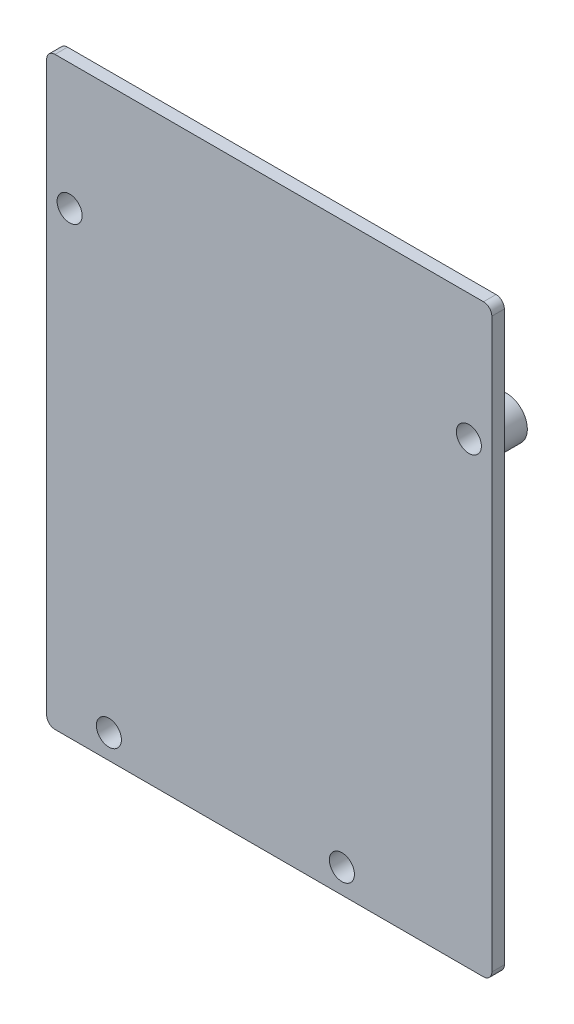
ISO-10303-21;
HEADER;
FILE_DESCRIPTION(('STEP AP214'),'2;1');
FILE_NAME('part.step','',(''),(''),'','','');
FILE_SCHEMA(('AUTOMOTIVE_DESIGN { 1 0 10303 214 1 1 1 1 }'));
ENDSEC;
DATA;
#1=APPLICATION_CONTEXT('core data for automotive mechanical design processes');
#2=APPLICATION_PROTOCOL_DEFINITION('international standard','automotive_design',2000,#1);
#3=PRODUCT_CONTEXT('',#1,'mechanical');
#4=PRODUCT('Part','Part','',(#3));
#5=PRODUCT_RELATED_PRODUCT_CATEGORY('part','',(#4));
#6=PRODUCT_DEFINITION_FORMATION('','',#4);
#7=PRODUCT_DEFINITION_CONTEXT('part definition',#1,'design');
#8=PRODUCT_DEFINITION('design','',#6,#7);
#9=PRODUCT_DEFINITION_SHAPE('','',#8);
#10=(LENGTH_UNIT() NAMED_UNIT(*) SI_UNIT(.MILLI.,.METRE.));
#11=(NAMED_UNIT(*) PLANE_ANGLE_UNIT() SI_UNIT($,.RADIAN.));
#12=(NAMED_UNIT(*) SI_UNIT($,.STERADIAN.) SOLID_ANGLE_UNIT());
#13=UNCERTAINTY_MEASURE_WITH_UNIT(LENGTH_MEASURE(1.E-05),#10,'distance_accuracy_value','');
#14=(GEOMETRIC_REPRESENTATION_CONTEXT(3) GLOBAL_UNCERTAINTY_ASSIGNED_CONTEXT((#13)) GLOBAL_UNIT_ASSIGNED_CONTEXT((#10,
#11,#12)) REPRESENTATION_CONTEXT('',''));
#15=CARTESIAN_POINT('',(0.,0.,0.));
#16=DIRECTION('',(0.,0.,1.));
#17=DIRECTION('',(1.,0.,0.));
#18=AXIS2_PLACEMENT_3D('',#15,#16,#17);
#19=CARTESIAN_POINT('',(-26.65,35.,1.5));
#20=DIRECTION('',(1.,0.,0.));
#21=DIRECTION('',(0.,1.,0.));
#22=AXIS2_PLACEMENT_3D('',#19,#20,#21);
#23=PLANE('',#22);
#24=DIRECTION('',(0.,-1.,0.));
#25=VECTOR('',#24,1.);
#26=CARTESIAN_POINT('',(-26.65,35.,0.));
#27=LINE('',#26,#25);
#28=CARTESIAN_POINT('',(-26.65,34.,0.));
#29=VERTEX_POINT('',#28);
#30=CARTESIAN_POINT('',(-26.65,-34.,0.));
#31=VERTEX_POINT('',#30);
#32=EDGE_CURVE('E129',#29,#31,#27,.T.);
#33=ORIENTED_EDGE('',*,*,#32,.T.);
#34=DIRECTION('',(0.,0.,-1.));
#35=VECTOR('',#34,1.);
#36=CARTESIAN_POINT('',(-26.65,-34.,1.5));
#37=LINE('',#36,#35);
#38=CARTESIAN_POINT('',(-26.65,-34.,1.5));
#39=VERTEX_POINT('',#38);
#40=EDGE_CURVE('E107',#31,#39,#37,.F.);
#41=ORIENTED_EDGE('',*,*,#40,.T.);
#42=DIRECTION('',(0.,-1.,0.));
#43=VECTOR('',#42,1.);
#44=CARTESIAN_POINT('',(-26.65,35.,1.5));
#45=LINE('',#44,#43);
#46=CARTESIAN_POINT('',(-26.65,34.,1.5));
#47=VERTEX_POINT('',#46);
#48=EDGE_CURVE('E139',#47,#39,#45,.T.);
#49=ORIENTED_EDGE('',*,*,#48,.F.);
#50=DIRECTION('',(0.,0.,-1.));
#51=VECTOR('',#50,1.);
#52=CARTESIAN_POINT('',(-26.65,34.,1.5));
#53=LINE('',#52,#51);
#54=EDGE_CURVE('E112',#47,#29,#53,.T.);
#55=ORIENTED_EDGE('',*,*,#54,.T.);
#56=EDGE_LOOP('',(#33,#41,#49,#55));
#57=FACE_BOUND('',#56,.T.);
#58=ADVANCED_FACE('F35',(#57),#23,.F.);
#59=CARTESIAN_POINT('',(-26.65,-35.,1.5));
#60=DIRECTION('',(0.,1.,0.));
#61=DIRECTION('',(0.,0.,1.));
#62=AXIS2_PLACEMENT_3D('',#59,#60,#61);
#63=PLANE('',#62);
#64=DIRECTION('',(1.,0.,0.));
#65=VECTOR('',#64,1.);
#66=CARTESIAN_POINT('',(-26.65,-35.,1.5));
#67=LINE('',#66,#65);
#68=CARTESIAN_POINT('',(-25.65,-35.,1.5));
#69=VERTEX_POINT('',#68);
#70=CARTESIAN_POINT('',(25.65,-35.,1.5));
#71=VERTEX_POINT('',#70);
#72=EDGE_CURVE('E122',#69,#71,#67,.T.);
#73=ORIENTED_EDGE('',*,*,#72,.F.);
#74=DIRECTION('',(0.,0.,-1.));
#75=VECTOR('',#74,1.);
#76=CARTESIAN_POINT('',(-25.65,-35.,1.5));
#77=LINE('',#76,#75);
#78=CARTESIAN_POINT('',(-25.65,-35.,0.));
#79=VERTEX_POINT('',#78);
#80=EDGE_CURVE('E106',#69,#79,#77,.T.);
#81=ORIENTED_EDGE('',*,*,#80,.T.);
#82=DIRECTION('',(1.,0.,0.));
#83=VECTOR('',#82,1.);
#84=CARTESIAN_POINT('',(-26.65,-35.,0.));
#85=LINE('',#84,#83);
#86=CARTESIAN_POINT('',(25.65,-35.,0.));
#87=VERTEX_POINT('',#86);
#88=EDGE_CURVE('E119',#79,#87,#85,.T.);
#89=ORIENTED_EDGE('',*,*,#88,.T.);
#90=DIRECTION('',(0.,0.,-1.));
#91=VECTOR('',#90,1.);
#92=CARTESIAN_POINT('',(25.65,-35.,1.5));
#93=LINE('',#92,#91);
#94=EDGE_CURVE('E124',#87,#71,#93,.F.);
#95=ORIENTED_EDGE('',*,*,#94,.T.);
#96=EDGE_LOOP('',(#73,#81,#89,#95));
#97=FACE_BOUND('',#96,.T.);
#98=ADVANCED_FACE('F118',(#97),#63,.F.);
#99=CARTESIAN_POINT('',(26.65,35.,1.5));
#100=DIRECTION('',(-1.,0.,0.));
#101=DIRECTION('',(0.,-1.,0.));
#102=AXIS2_PLACEMENT_3D('',#99,#100,#101);
#103=PLANE('',#102);
#104=DIRECTION('',(0.,1.,0.));
#105=VECTOR('',#104,1.);
#106=CARTESIAN_POINT('',(26.65,35.,1.5));
#107=LINE('',#106,#105);
#108=CARTESIAN_POINT('',(26.65,-34.,1.5));
#109=VERTEX_POINT('',#108);
#110=CARTESIAN_POINT('',(26.65,34.,1.5));
#111=VERTEX_POINT('',#110);
#112=EDGE_CURVE('E228',#109,#111,#107,.T.);
#113=ORIENTED_EDGE('',*,*,#112,.F.);
#114=DIRECTION('',(0.,0.,-1.));
#115=VECTOR('',#114,1.);
#116=CARTESIAN_POINT('',(26.65,-34.,1.5));
#117=LINE('',#116,#115);
#118=CARTESIAN_POINT('',(26.65,-34.,0.));
#119=VERTEX_POINT('',#118);
#120=EDGE_CURVE('E158',#109,#119,#117,.T.);
#121=ORIENTED_EDGE('',*,*,#120,.T.);
#122=DIRECTION('',(0.,1.,0.));
#123=VECTOR('',#122,1.);
#124=CARTESIAN_POINT('',(26.65,35.,0.));
#125=LINE('',#124,#123);
#126=CARTESIAN_POINT('',(26.65,34.,0.));
#127=VERTEX_POINT('',#126);
#128=EDGE_CURVE('E128',#119,#127,#125,.T.);
#129=ORIENTED_EDGE('',*,*,#128,.T.);
#130=DIRECTION('',(0.,0.,-1.));
#131=VECTOR('',#130,1.);
#132=CARTESIAN_POINT('',(26.65,34.,1.5));
#133=LINE('',#132,#131);
#134=EDGE_CURVE('E156',#127,#111,#133,.F.);
#135=ORIENTED_EDGE('',*,*,#134,.T.);
#136=EDGE_LOOP('',(#113,#121,#129,#135));
#137=FACE_BOUND('',#136,.T.);
#138=ADVANCED_FACE('F206',(#137),#103,.F.);
#139=CARTESIAN_POINT('',(-26.65,35.,1.5));
#140=DIRECTION('',(0.,-1.,0.));
#141=DIRECTION('',(0.,0.,-1.));
#142=AXIS2_PLACEMENT_3D('',#139,#140,#141);
#143=PLANE('',#142);
#144=DIRECTION('',(-1.,0.,0.));
#145=VECTOR('',#144,1.);
#146=CARTESIAN_POINT('',(-26.65,35.,1.5));
#147=LINE('',#146,#145);
#148=CARTESIAN_POINT('',(25.65,35.,1.5));
#149=VERTEX_POINT('',#148);
#150=CARTESIAN_POINT('',(-25.65,35.,1.5));
#151=VERTEX_POINT('',#150);
#152=EDGE_CURVE('E140',#149,#151,#147,.T.);
#153=ORIENTED_EDGE('',*,*,#152,.F.);
#154=DIRECTION('',(0.,0.,-1.));
#155=VECTOR('',#154,1.);
#156=CARTESIAN_POINT('',(25.65,35.,1.5));
#157=LINE('',#156,#155);
#158=CARTESIAN_POINT('',(25.65,35.,0.));
#159=VERTEX_POINT('',#158);
#160=EDGE_CURVE('E162',#149,#159,#157,.T.);
#161=ORIENTED_EDGE('',*,*,#160,.T.);
#162=DIRECTION('',(-1.,0.,0.));
#163=VECTOR('',#162,1.);
#164=CARTESIAN_POINT('',(-26.65,35.,0.));
#165=LINE('',#164,#163);
#166=CARTESIAN_POINT('',(-25.65,35.,0.));
#167=VERTEX_POINT('',#166);
#168=EDGE_CURVE('E132',#159,#167,#165,.T.);
#169=ORIENTED_EDGE('',*,*,#168,.T.);
#170=DIRECTION('',(0.,0.,-1.));
#171=VECTOR('',#170,1.);
#172=CARTESIAN_POINT('',(-25.65,35.,1.5));
#173=LINE('',#172,#171);
#174=EDGE_CURVE('E50',#167,#151,#173,.F.);
#175=ORIENTED_EDGE('',*,*,#174,.T.);
#176=EDGE_LOOP('',(#153,#161,#169,#175));
#177=FACE_BOUND('',#176,.T.);
#178=ADVANCED_FACE('F222',(#177),#143,.F.);
#179=CARTESIAN_POINT('',(0.,0.,1.5));
#180=DIRECTION('',(0.,0.,1.));
#181=DIRECTION('',(1.,0.,0.));
#182=AXIS2_PLACEMENT_3D('',#179,#180,#181);
#183=PLANE('',#182);
#184=CARTESIAN_POINT('',(-19.2,-32.1,1.5));
#185=DIRECTION('',(0.,0.,1.));
#186=DIRECTION('',(1.,0.,0.));
#187=AXIS2_PLACEMENT_3D('',#184,#185,#186);
#188=CIRCLE('',#187,1.5);
#189=CARTESIAN_POINT('',(-17.7,-32.1,1.5));
#190=VERTEX_POINT('',#189);
#191=EDGE_CURVE('E400',#190,#190,#188,.T.);
#192=ORIENTED_EDGE('',*,*,#191,.F.);
#193=EDGE_LOOP('',(#192));
#194=FACE_BOUND('',#193,.T.);
#195=CARTESIAN_POINT('',(8.7,-32.1,1.5));
#196=DIRECTION('',(0.,0.,1.));
#197=DIRECTION('',(1.,0.,0.));
#198=AXIS2_PLACEMENT_3D('',#195,#196,#197);
#199=CIRCLE('',#198,1.5);
#200=CARTESIAN_POINT('',(10.2,-32.1,1.5));
#201=VERTEX_POINT('',#200);
#202=EDGE_CURVE('E410',#201,#201,#199,.T.);
#203=ORIENTED_EDGE('',*,*,#202,.F.);
#204=EDGE_LOOP('',(#203));
#205=FACE_BOUND('',#204,.T.);
#206=CARTESIAN_POINT('',(-23.9,19.9,1.5));
#207=DIRECTION('',(0.,0.,1.));
#208=DIRECTION('',(1.,0.,0.));
#209=AXIS2_PLACEMENT_3D('',#206,#207,#208);
#210=CIRCLE('',#209,1.5);
#211=CARTESIAN_POINT('',(-22.4,19.9,1.5));
#212=VERTEX_POINT('',#211);
#213=EDGE_CURVE('E416',#212,#212,#210,.T.);
#214=ORIENTED_EDGE('',*,*,#213,.F.);
#215=EDGE_LOOP('',(#214));
#216=FACE_BOUND('',#215,.T.);
#217=CARTESIAN_POINT('',(23.9,19.9,1.5));
#218=DIRECTION('',(0.,0.,1.));
#219=DIRECTION('',(1.,0.,0.));
#220=AXIS2_PLACEMENT_3D('',#217,#218,#219);
#221=CIRCLE('',#220,1.5);
#222=CARTESIAN_POINT('',(25.4,19.9,1.5));
#223=VERTEX_POINT('',#222);
#224=EDGE_CURVE('E422',#223,#223,#221,.T.);
#225=ORIENTED_EDGE('',*,*,#224,.F.);
#226=EDGE_LOOP('',(#225));
#227=FACE_BOUND('',#226,.T.);
#228=ORIENTED_EDGE('',*,*,#48,.T.);
#229=CARTESIAN_POINT('',(-25.65,-34.,1.5));
#230=DIRECTION('',(0.,0.,1.));
#231=DIRECTION('',(1.,0.,0.));
#232=AXIS2_PLACEMENT_3D('',#229,#230,#231);
#233=CIRCLE('',#232,1.);
#234=EDGE_CURVE('E154',#39,#69,#233,.T.);
#235=ORIENTED_EDGE('',*,*,#234,.T.);
#236=ORIENTED_EDGE('',*,*,#72,.T.);
#237=CARTESIAN_POINT('',(25.65,-34.,1.5));
#238=DIRECTION('',(0.,0.,1.));
#239=DIRECTION('',(1.,0.,0.));
#240=AXIS2_PLACEMENT_3D('',#237,#238,#239);
#241=CIRCLE('',#240,1.);
#242=EDGE_CURVE('E152',#71,#109,#241,.T.);
#243=ORIENTED_EDGE('',*,*,#242,.T.);
#244=ORIENTED_EDGE('',*,*,#112,.T.);
#245=CARTESIAN_POINT('',(25.65,34.,1.5));
#246=DIRECTION('',(0.,0.,1.));
#247=DIRECTION('',(1.,0.,0.));
#248=AXIS2_PLACEMENT_3D('',#245,#246,#247);
#249=CIRCLE('',#248,1.);
#250=EDGE_CURVE('E57',#111,#149,#249,.T.);
#251=ORIENTED_EDGE('',*,*,#250,.T.);
#252=ORIENTED_EDGE('',*,*,#152,.T.);
#253=CARTESIAN_POINT('',(-25.65,34.,1.5));
#254=DIRECTION('',(0.,0.,1.));
#255=DIRECTION('',(1.,0.,0.));
#256=AXIS2_PLACEMENT_3D('',#253,#254,#255);
#257=CIRCLE('',#256,1.);
#258=EDGE_CURVE('E149',#151,#47,#257,.T.);
#259=ORIENTED_EDGE('',*,*,#258,.T.);
#260=EDGE_LOOP('',(#228,#235,#236,#243,#244,#251,#252,#259));
#261=FACE_BOUND('',#260,.T.);
#262=ADVANCED_FACE('F177',(#194,#205,#216,#227,#261),#183,.T.);
#263=CARTESIAN_POINT('',(0.,0.,0.));
#264=DIRECTION('',(0.,0.,1.));
#265=DIRECTION('',(1.,0.,0.));
#266=AXIS2_PLACEMENT_3D('',#263,#264,#265);
#267=PLANE('',#266);
#268=CARTESIAN_POINT('',(-19.2,-32.1,0.));
#269=DIRECTION('',(0.,0.,1.));
#270=DIRECTION('',(1.,0.,0.));
#271=AXIS2_PLACEMENT_3D('',#268,#269,#270);
#272=CIRCLE('',#271,2.5);
#273=CARTESIAN_POINT('',(-16.7,-32.1,0.));
#274=VERTEX_POINT('',#273);
#275=EDGE_CURVE('E11',#274,#274,#272,.F.);
#276=ORIENTED_EDGE('',*,*,#275,.F.);
#277=EDGE_LOOP('',(#276));
#278=FACE_BOUND('',#277,.T.);
#279=CARTESIAN_POINT('',(8.7,-32.1,0.));
#280=DIRECTION('',(0.,0.,1.));
#281=DIRECTION('',(1.,0.,0.));
#282=AXIS2_PLACEMENT_3D('',#279,#280,#281);
#283=CIRCLE('',#282,2.5);
#284=CARTESIAN_POINT('',(11.2,-32.1,0.));
#285=VERTEX_POINT('',#284);
#286=EDGE_CURVE('E43',#285,#285,#283,.F.);
#287=ORIENTED_EDGE('',*,*,#286,.F.);
#288=EDGE_LOOP('',(#287));
#289=FACE_BOUND('',#288,.T.);
#290=CARTESIAN_POINT('',(-23.9,19.9,0.));
#291=DIRECTION('',(0.,0.,1.));
#292=DIRECTION('',(1.,0.,0.));
#293=AXIS2_PLACEMENT_3D('',#290,#291,#292);
#294=CIRCLE('',#293,2.5);
#295=CARTESIAN_POINT('',(-21.4,19.9,0.));
#296=VERTEX_POINT('',#295);
#297=EDGE_CURVE('E168',#296,#296,#294,.F.);
#298=ORIENTED_EDGE('',*,*,#297,.F.);
#299=EDGE_LOOP('',(#298));
#300=FACE_BOUND('',#299,.T.);
#301=CARTESIAN_POINT('',(23.9,19.9,0.));
#302=DIRECTION('',(0.,0.,1.));
#303=DIRECTION('',(1.,0.,0.));
#304=AXIS2_PLACEMENT_3D('',#301,#302,#303);
#305=CIRCLE('',#304,2.5);
#306=CARTESIAN_POINT('',(26.4,19.9,0.));
#307=VERTEX_POINT('',#306);
#308=EDGE_CURVE('E165',#307,#307,#305,.F.);
#309=ORIENTED_EDGE('',*,*,#308,.F.);
#310=EDGE_LOOP('',(#309));
#311=FACE_BOUND('',#310,.T.);
#312=ORIENTED_EDGE('',*,*,#88,.F.);
#313=CARTESIAN_POINT('',(-25.65,-34.,0.));
#314=DIRECTION('',(0.,0.,1.));
#315=DIRECTION('',(1.,0.,0.));
#316=AXIS2_PLACEMENT_3D('',#313,#314,#315);
#317=CIRCLE('',#316,1.);
#318=EDGE_CURVE('E102',#79,#31,#317,.F.);
#319=ORIENTED_EDGE('',*,*,#318,.T.);
#320=ORIENTED_EDGE('',*,*,#32,.F.);
#321=CARTESIAN_POINT('',(-25.65,34.,0.));
#322=DIRECTION('',(0.,0.,1.));
#323=DIRECTION('',(1.,0.,0.));
#324=AXIS2_PLACEMENT_3D('',#321,#322,#323);
#325=CIRCLE('',#324,1.);
#326=EDGE_CURVE('E123',#29,#167,#325,.F.);
#327=ORIENTED_EDGE('',*,*,#326,.T.);
#328=ORIENTED_EDGE('',*,*,#168,.F.);
#329=CARTESIAN_POINT('',(25.65,34.,0.));
#330=DIRECTION('',(0.,0.,1.));
#331=DIRECTION('',(1.,0.,0.));
#332=AXIS2_PLACEMENT_3D('',#329,#330,#331);
#333=CIRCLE('',#332,1.);
#334=EDGE_CURVE('E143',#159,#127,#333,.F.);
#335=ORIENTED_EDGE('',*,*,#334,.T.);
#336=ORIENTED_EDGE('',*,*,#128,.F.);
#337=CARTESIAN_POINT('',(25.65,-34.,0.));
#338=DIRECTION('',(0.,0.,1.));
#339=DIRECTION('',(1.,0.,0.));
#340=AXIS2_PLACEMENT_3D('',#337,#338,#339);
#341=CIRCLE('',#340,1.);
#342=EDGE_CURVE('E113',#119,#87,#341,.F.);
#343=ORIENTED_EDGE('',*,*,#342,.T.);
#344=EDGE_LOOP('',(#312,#319,#320,#327,#328,#335,#336,#343));
#345=FACE_BOUND('',#344,.T.);
#346=ADVANCED_FACE('F126',(#278,#289,#300,#311,#345),#267,.F.);
#347=CARTESIAN_POINT('',(-25.65,-34.,1.5));
#348=DIRECTION('',(0.,0.,-1.));
#349=DIRECTION('',(-1.,0.,0.));
#350=AXIS2_PLACEMENT_3D('',#347,#348,#349);
#351=CYLINDRICAL_SURFACE('',#350,1.);
#352=ORIENTED_EDGE('',*,*,#234,.F.);
#353=ORIENTED_EDGE('',*,*,#40,.F.);
#354=ORIENTED_EDGE('',*,*,#318,.F.);
#355=ORIENTED_EDGE('',*,*,#80,.F.);
#356=EDGE_LOOP('',(#352,#353,#354,#355));
#357=FACE_BOUND('',#356,.T.);
#358=ADVANCED_FACE('F105',(#357),#351,.T.);
#359=CARTESIAN_POINT('',(25.65,-34.,1.5));
#360=DIRECTION('',(0.,0.,-1.));
#361=DIRECTION('',(-1.,0.,0.));
#362=AXIS2_PLACEMENT_3D('',#359,#360,#361);
#363=CYLINDRICAL_SURFACE('',#362,1.);
#364=ORIENTED_EDGE('',*,*,#242,.F.);
#365=ORIENTED_EDGE('',*,*,#94,.F.);
#366=ORIENTED_EDGE('',*,*,#342,.F.);
#367=ORIENTED_EDGE('',*,*,#120,.F.);
#368=EDGE_LOOP('',(#364,#365,#366,#367));
#369=FACE_BOUND('',#368,.T.);
#370=ADVANCED_FACE('F212',(#369),#363,.T.);
#371=CARTESIAN_POINT('',(25.65,34.,1.5));
#372=DIRECTION('',(0.,0.,-1.));
#373=DIRECTION('',(-1.,0.,0.));
#374=AXIS2_PLACEMENT_3D('',#371,#372,#373);
#375=CYLINDRICAL_SURFACE('',#374,1.);
#376=ORIENTED_EDGE('',*,*,#250,.F.);
#377=ORIENTED_EDGE('',*,*,#134,.F.);
#378=ORIENTED_EDGE('',*,*,#334,.F.);
#379=ORIENTED_EDGE('',*,*,#160,.F.);
#380=EDGE_LOOP('',(#376,#377,#378,#379));
#381=FACE_BOUND('',#380,.T.);
#382=ADVANCED_FACE('F196',(#381),#375,.T.);
#383=CARTESIAN_POINT('',(-25.65,34.,1.5));
#384=DIRECTION('',(0.,0.,-1.));
#385=DIRECTION('',(-1.,0.,0.));
#386=AXIS2_PLACEMENT_3D('',#383,#384,#385);
#387=CYLINDRICAL_SURFACE('',#386,1.);
#388=ORIENTED_EDGE('',*,*,#258,.F.);
#389=ORIENTED_EDGE('',*,*,#174,.F.);
#390=ORIENTED_EDGE('',*,*,#326,.F.);
#391=ORIENTED_EDGE('',*,*,#54,.F.);
#392=EDGE_LOOP('',(#388,#389,#390,#391));
#393=FACE_BOUND('',#392,.T.);
#394=ADVANCED_FACE('F37',(#393),#387,.T.);
#395=CARTESIAN_POINT('',(23.9,19.9,-3.));
#396=DIRECTION('',(0.,0.,1.));
#397=DIRECTION('',(1.,0.,0.));
#398=AXIS2_PLACEMENT_3D('',#395,#396,#397);
#399=CYLINDRICAL_SURFACE('',#398,2.5);
#400=CARTESIAN_POINT('',(23.9,19.9,-3.));
#401=DIRECTION('',(0.,0.,-1.));
#402=DIRECTION('',(-1.,0.,0.));
#403=AXIS2_PLACEMENT_3D('',#400,#401,#402);
#404=CIRCLE('',#403,2.5);
#405=CARTESIAN_POINT('',(21.4,19.9,-3.));
#406=VERTEX_POINT('',#405);
#407=EDGE_CURVE('E134',#406,#406,#404,.T.);
#408=ORIENTED_EDGE('',*,*,#407,.F.);
#409=EDGE_LOOP('',(#408));
#410=FACE_BOUND('',#409,.T.);
#411=ORIENTED_EDGE('',*,*,#308,.T.);
#412=EDGE_LOOP('',(#411));
#413=FACE_BOUND('',#412,.T.);
#414=ADVANCED_FACE('F184',(#410,#413),#399,.T.);
#415=CARTESIAN_POINT('',(23.9,19.9,-3.));
#416=DIRECTION('',(0.,0.,-1.));
#417=DIRECTION('',(-1.,0.,0.));
#418=AXIS2_PLACEMENT_3D('',#415,#416,#417);
#419=PLANE('',#418);
#420=CARTESIAN_POINT('',(23.9,19.9,-3.));
#421=DIRECTION('',(0.,0.,-1.));
#422=DIRECTION('',(-1.,0.,0.));
#423=AXIS2_PLACEMENT_3D('',#420,#421,#422);
#424=CIRCLE('',#423,1.5);
#425=CARTESIAN_POINT('',(22.4,19.9,-3.));
#426=VERTEX_POINT('',#425);
#427=EDGE_CURVE('E419',#426,#426,#424,.T.);
#428=ORIENTED_EDGE('',*,*,#427,.F.);
#429=EDGE_LOOP('',(#428));
#430=FACE_BOUND('',#429,.T.);
#431=ORIENTED_EDGE('',*,*,#407,.T.);
#432=EDGE_LOOP('',(#431));
#433=FACE_BOUND('',#432,.T.);
#434=ADVANCED_FACE('F186',(#430,#433),#419,.T.);
#435=CARTESIAN_POINT('',(-23.9,19.9,-3.));
#436=DIRECTION('',(0.,0.,1.));
#437=DIRECTION('',(1.,0.,0.));
#438=AXIS2_PLACEMENT_3D('',#435,#436,#437);
#439=CYLINDRICAL_SURFACE('',#438,2.5);
#440=CARTESIAN_POINT('',(-23.9,19.9,-3.));
#441=DIRECTION('',(0.,0.,-1.));
#442=DIRECTION('',(-1.,0.,0.));
#443=AXIS2_PLACEMENT_3D('',#440,#441,#442);
#444=CIRCLE('',#443,2.5);
#445=CARTESIAN_POINT('',(-26.4,19.9,-3.));
#446=VERTEX_POINT('',#445);
#447=EDGE_CURVE('E430',#446,#446,#444,.T.);
#448=ORIENTED_EDGE('',*,*,#447,.F.);
#449=EDGE_LOOP('',(#448));
#450=FACE_BOUND('',#449,.T.);
#451=ORIENTED_EDGE('',*,*,#297,.T.);
#452=EDGE_LOOP('',(#451));
#453=FACE_BOUND('',#452,.T.);
#454=ADVANCED_FACE('F193',(#450,#453),#439,.T.);
#455=CARTESIAN_POINT('',(-23.9,19.9,-3.));
#456=DIRECTION('',(0.,0.,-1.));
#457=DIRECTION('',(-1.,0.,0.));
#458=AXIS2_PLACEMENT_3D('',#455,#456,#457);
#459=PLANE('',#458);
#460=CARTESIAN_POINT('',(-23.9,19.9,-3.));
#461=DIRECTION('',(0.,0.,-1.));
#462=DIRECTION('',(-1.,0.,0.));
#463=AXIS2_PLACEMENT_3D('',#460,#461,#462);
#464=CIRCLE('',#463,1.5);
#465=CARTESIAN_POINT('',(-25.4,19.9,-3.));
#466=VERTEX_POINT('',#465);
#467=EDGE_CURVE('E413',#466,#466,#464,.T.);
#468=ORIENTED_EDGE('',*,*,#467,.F.);
#469=EDGE_LOOP('',(#468));
#470=FACE_BOUND('',#469,.T.);
#471=ORIENTED_EDGE('',*,*,#447,.T.);
#472=EDGE_LOOP('',(#471));
#473=FACE_BOUND('',#472,.T.);
#474=ADVANCED_FACE('F297',(#470,#473),#459,.T.);
#475=CARTESIAN_POINT('',(8.7,-32.1,-3.));
#476=DIRECTION('',(0.,0.,1.));
#477=DIRECTION('',(1.,0.,0.));
#478=AXIS2_PLACEMENT_3D('',#475,#476,#477);
#479=CYLINDRICAL_SURFACE('',#478,2.5);
#480=CARTESIAN_POINT('',(8.7,-32.1,-3.));
#481=DIRECTION('',(0.,0.,-1.));
#482=DIRECTION('',(-1.,0.,0.));
#483=AXIS2_PLACEMENT_3D('',#480,#481,#482);
#484=CIRCLE('',#483,2.5);
#485=CARTESIAN_POINT('',(6.2,-32.1,-3.));
#486=VERTEX_POINT('',#485);
#487=EDGE_CURVE('E428',#486,#486,#484,.T.);
#488=ORIENTED_EDGE('',*,*,#487,.F.);
#489=EDGE_LOOP('',(#488));
#490=FACE_BOUND('',#489,.T.);
#491=ORIENTED_EDGE('',*,*,#286,.T.);
#492=EDGE_LOOP('',(#491));
#493=FACE_BOUND('',#492,.T.);
#494=ADVANCED_FACE('F173',(#490,#493),#479,.T.);
#495=CARTESIAN_POINT('',(8.7,-32.1,-3.));
#496=DIRECTION('',(0.,0.,-1.));
#497=DIRECTION('',(-1.,0.,0.));
#498=AXIS2_PLACEMENT_3D('',#495,#496,#497);
#499=PLANE('',#498);
#500=CARTESIAN_POINT('',(8.7,-32.1,-3.));
#501=DIRECTION('',(0.,0.,-1.));
#502=DIRECTION('',(-1.,0.,0.));
#503=AXIS2_PLACEMENT_3D('',#500,#501,#502);
#504=CIRCLE('',#503,1.5);
#505=CARTESIAN_POINT('',(7.2,-32.1,-3.));
#506=VERTEX_POINT('',#505);
#507=EDGE_CURVE('E405',#506,#506,#504,.T.);
#508=ORIENTED_EDGE('',*,*,#507,.F.);
#509=EDGE_LOOP('',(#508));
#510=FACE_BOUND('',#509,.T.);
#511=ORIENTED_EDGE('',*,*,#487,.T.);
#512=EDGE_LOOP('',(#511));
#513=FACE_BOUND('',#512,.T.);
#514=ADVANCED_FACE('F309',(#510,#513),#499,.T.);
#515=CARTESIAN_POINT('',(-19.2,-32.1,-3.));
#516=DIRECTION('',(0.,0.,1.));
#517=DIRECTION('',(1.,0.,0.));
#518=AXIS2_PLACEMENT_3D('',#515,#516,#517);
#519=CYLINDRICAL_SURFACE('',#518,2.5);
#520=CARTESIAN_POINT('',(-19.2,-32.1,-3.));
#521=DIRECTION('',(0.,0.,-1.));
#522=DIRECTION('',(-1.,0.,0.));
#523=AXIS2_PLACEMENT_3D('',#520,#521,#522);
#524=CIRCLE('',#523,2.5);
#525=CARTESIAN_POINT('',(-21.7,-32.1,-3.));
#526=VERTEX_POINT('',#525);
#527=EDGE_CURVE('E425',#526,#526,#524,.T.);
#528=ORIENTED_EDGE('',*,*,#527,.F.);
#529=EDGE_LOOP('',(#528));
#530=FACE_BOUND('',#529,.T.);
#531=ORIENTED_EDGE('',*,*,#275,.T.);
#532=EDGE_LOOP('',(#531));
#533=FACE_BOUND('',#532,.T.);
#534=ADVANCED_FACE('F317',(#530,#533),#519,.T.);
#535=CARTESIAN_POINT('',(-19.2,-32.1,-3.));
#536=DIRECTION('',(0.,0.,-1.));
#537=DIRECTION('',(-1.,0.,0.));
#538=AXIS2_PLACEMENT_3D('',#535,#536,#537);
#539=PLANE('',#538);
#540=CARTESIAN_POINT('',(-19.2,-32.1,-3.));
#541=DIRECTION('',(0.,0.,-1.));
#542=DIRECTION('',(-1.,0.,0.));
#543=AXIS2_PLACEMENT_3D('',#540,#541,#542);
#544=CIRCLE('',#543,1.5);
#545=CARTESIAN_POINT('',(-20.7,-32.1,-3.));
#546=VERTEX_POINT('',#545);
#547=EDGE_CURVE('E403',#546,#546,#544,.T.);
#548=ORIENTED_EDGE('',*,*,#547,.F.);
#549=EDGE_LOOP('',(#548));
#550=FACE_BOUND('',#549,.T.);
#551=ORIENTED_EDGE('',*,*,#527,.T.);
#552=EDGE_LOOP('',(#551));
#553=FACE_BOUND('',#552,.T.);
#554=ADVANCED_FACE('F322',(#550,#553),#539,.T.);
#555=CARTESIAN_POINT('',(23.9,19.9,3.));
#556=DIRECTION('',(0.,0.,-1.));
#557=DIRECTION('',(-1.,0.,0.));
#558=AXIS2_PLACEMENT_3D('',#555,#556,#557);
#559=CYLINDRICAL_SURFACE('',#558,1.5);
#560=ORIENTED_EDGE('',*,*,#224,.T.);
#561=EDGE_LOOP('',(#560));
#562=FACE_BOUND('',#561,.T.);
#563=ORIENTED_EDGE('',*,*,#427,.T.);
#564=EDGE_LOOP('',(#563));
#565=FACE_BOUND('',#564,.T.);
#566=ADVANCED_FACE('F335',(#562,#565),#559,.F.);
#567=CARTESIAN_POINT('',(-23.9,19.9,3.));
#568=DIRECTION('',(0.,0.,-1.));
#569=DIRECTION('',(-1.,0.,0.));
#570=AXIS2_PLACEMENT_3D('',#567,#568,#569);
#571=CYLINDRICAL_SURFACE('',#570,1.5);
#572=ORIENTED_EDGE('',*,*,#213,.T.);
#573=EDGE_LOOP('',(#572));
#574=FACE_BOUND('',#573,.T.);
#575=ORIENTED_EDGE('',*,*,#467,.T.);
#576=EDGE_LOOP('',(#575));
#577=FACE_BOUND('',#576,.T.);
#578=ADVANCED_FACE('F340',(#574,#577),#571,.F.);
#579=CARTESIAN_POINT('',(8.7,-32.1,3.));
#580=DIRECTION('',(0.,0.,-1.));
#581=DIRECTION('',(-1.,0.,0.));
#582=AXIS2_PLACEMENT_3D('',#579,#580,#581);
#583=CYLINDRICAL_SURFACE('',#582,1.5);
#584=ORIENTED_EDGE('',*,*,#202,.T.);
#585=EDGE_LOOP('',(#584));
#586=FACE_BOUND('',#585,.T.);
#587=ORIENTED_EDGE('',*,*,#507,.T.);
#588=EDGE_LOOP('',(#587));
#589=FACE_BOUND('',#588,.T.);
#590=ADVANCED_FACE('F357',(#586,#589),#583,.F.);
#591=CARTESIAN_POINT('',(-19.2,-32.1,3.));
#592=DIRECTION('',(0.,0.,-1.));
#593=DIRECTION('',(-1.,0.,0.));
#594=AXIS2_PLACEMENT_3D('',#591,#592,#593);
#595=CYLINDRICAL_SURFACE('',#594,1.5);
#596=ORIENTED_EDGE('',*,*,#191,.T.);
#597=EDGE_LOOP('',(#596));
#598=FACE_BOUND('',#597,.T.);
#599=ORIENTED_EDGE('',*,*,#547,.T.);
#600=EDGE_LOOP('',(#599));
#601=FACE_BOUND('',#600,.T.);
#602=ADVANCED_FACE('F373',(#598,#601),#595,.F.);
#603=CLOSED_SHELL('',(#58,#98,#138,#178,#262,#346,#358,#370,#382,#394,#414,#434,#454,#474,#494,
#514,#534,#554,#566,#578,#590,#602));
#604=MANIFOLD_SOLID_BREP('B2',#603);
#605=ADVANCED_BREP_SHAPE_REPRESENTATION('',(#18,#604),#14);
#606=SHAPE_DEFINITION_REPRESENTATION(#9,#605);
ENDSEC;
END-ISO-10303-21;
